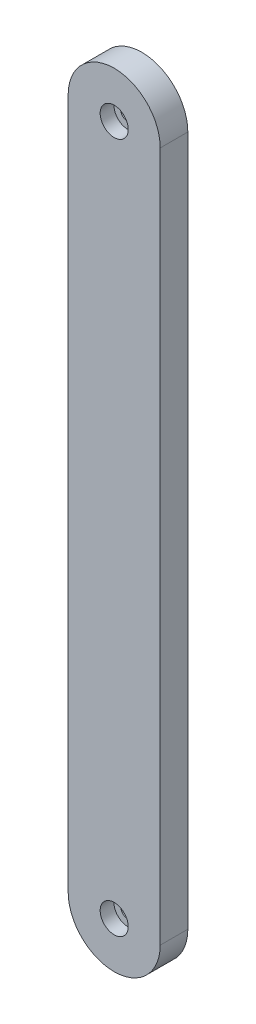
ISO-10303-21;
HEADER;
FILE_DESCRIPTION(('STEP AP214'),'2;1');
FILE_NAME('part.step','',(''),(''),'','','');
FILE_SCHEMA(('AUTOMOTIVE_DESIGN { 1 0 10303 214 1 1 1 1 }'));
ENDSEC;
DATA;
#1=APPLICATION_CONTEXT('core data for automotive mechanical design processes');
#2=APPLICATION_PROTOCOL_DEFINITION('international standard','automotive_design',2000,#1);
#3=PRODUCT_CONTEXT('',#1,'mechanical');
#4=PRODUCT('Part','Part','',(#3));
#5=PRODUCT_RELATED_PRODUCT_CATEGORY('part','',(#4));
#6=PRODUCT_DEFINITION_FORMATION('','',#4);
#7=PRODUCT_DEFINITION_CONTEXT('part definition',#1,'design');
#8=PRODUCT_DEFINITION('design','',#6,#7);
#9=PRODUCT_DEFINITION_SHAPE('','',#8);
#10=(LENGTH_UNIT() NAMED_UNIT(*) SI_UNIT(.MILLI.,.METRE.));
#11=(NAMED_UNIT(*) PLANE_ANGLE_UNIT() SI_UNIT($,.RADIAN.));
#12=(NAMED_UNIT(*) SI_UNIT($,.STERADIAN.) SOLID_ANGLE_UNIT());
#13=UNCERTAINTY_MEASURE_WITH_UNIT(LENGTH_MEASURE(1.E-05),#10,'distance_accuracy_value','');
#14=(GEOMETRIC_REPRESENTATION_CONTEXT(3) GLOBAL_UNCERTAINTY_ASSIGNED_CONTEXT((#13)) GLOBAL_UNIT_ASSIGNED_CONTEXT((#10,
#11,#12)) REPRESENTATION_CONTEXT('',''));
#15=CARTESIAN_POINT('',(0.,0.,0.));
#16=DIRECTION('',(0.,0.,1.));
#17=DIRECTION('',(1.,0.,0.));
#18=AXIS2_PLACEMENT_3D('',#15,#16,#17);
#19=CARTESIAN_POINT('',(0.,0.,6.));
#20=DIRECTION('',(0.,0.,-1.));
#21=DIRECTION('',(-1.,0.,0.));
#22=AXIS2_PLACEMENT_3D('',#19,#20,#21);
#23=CYLINDRICAL_SURFACE('',#22,1.6);
#24=CARTESIAN_POINT('',(0.,0.,0.));
#25=DIRECTION('',(0.,0.,1.));
#26=DIRECTION('',(1.,0.,0.));
#27=AXIS2_PLACEMENT_3D('',#24,#25,#26);
#28=CIRCLE('',#27,1.6);
#29=CARTESIAN_POINT('',(1.6,0.,0.));
#30=VERTEX_POINT('',#29);
#31=EDGE_CURVE('E104',#30,#30,#28,.T.);
#32=ORIENTED_EDGE('',*,*,#31,.F.);
#33=EDGE_LOOP('',(#32));
#34=FACE_BOUND('',#33,.T.);
#35=CARTESIAN_POINT('',(0.,0.,3.));
#36=DIRECTION('',(0.,0.,1.));
#37=DIRECTION('',(1.,0.,0.));
#38=AXIS2_PLACEMENT_3D('',#35,#36,#37);
#39=CIRCLE('',#38,1.6);
#40=CARTESIAN_POINT('',(1.6,0.,3.));
#41=VERTEX_POINT('',#40);
#42=EDGE_CURVE('E38',#41,#41,#39,.T.);
#43=ORIENTED_EDGE('',*,*,#42,.T.);
#44=EDGE_LOOP('',(#43));
#45=FACE_BOUND('',#44,.T.);
#46=ADVANCED_FACE('F34',(#34,#45),#23,.F.);
#47=CARTESIAN_POINT('',(0.,150.,6.));
#48=DIRECTION('',(0.,0.,-1.));
#49=DIRECTION('',(-1.,0.,0.));
#50=AXIS2_PLACEMENT_3D('',#47,#48,#49);
#51=CYLINDRICAL_SURFACE('',#50,1.6);
#52=CARTESIAN_POINT('',(0.,150.,0.));
#53=DIRECTION('',(0.,0.,1.));
#54=DIRECTION('',(1.,0.,0.));
#55=AXIS2_PLACEMENT_3D('',#52,#53,#54);
#56=CIRCLE('',#55,1.6);
#57=CARTESIAN_POINT('',(1.6,150.,0.));
#58=VERTEX_POINT('',#57);
#59=EDGE_CURVE('E111',#58,#58,#56,.T.);
#60=ORIENTED_EDGE('',*,*,#59,.F.);
#61=EDGE_LOOP('',(#60));
#62=FACE_BOUND('',#61,.T.);
#63=CARTESIAN_POINT('',(0.,150.,3.));
#64=DIRECTION('',(0.,0.,1.));
#65=DIRECTION('',(1.,0.,0.));
#66=AXIS2_PLACEMENT_3D('',#63,#64,#65);
#67=CIRCLE('',#66,1.6);
#68=CARTESIAN_POINT('',(1.6,150.,3.));
#69=VERTEX_POINT('',#68);
#70=EDGE_CURVE('E109',#69,#69,#67,.T.);
#71=ORIENTED_EDGE('',*,*,#70,.T.);
#72=EDGE_LOOP('',(#71));
#73=FACE_BOUND('',#72,.T.);
#74=ADVANCED_FACE('F136',(#62,#73),#51,.F.);
#75=CARTESIAN_POINT('',(0.,0.,6.));
#76=DIRECTION('',(0.,0.,1.));
#77=DIRECTION('',(1.,0.,0.));
#78=AXIS2_PLACEMENT_3D('',#75,#76,#77);
#79=PLANE('',#78);
#80=CARTESIAN_POINT('',(0.,0.,6.));
#81=DIRECTION('',(0.,0.,1.));
#82=DIRECTION('',(1.,0.,0.));
#83=AXIS2_PLACEMENT_3D('',#80,#81,#82);
#84=CIRCLE('',#83,3.05);
#85=CARTESIAN_POINT('',(3.05,0.,6.));
#86=VERTEX_POINT('',#85);
#87=EDGE_CURVE('E125',#86,#86,#84,.T.);
#88=ORIENTED_EDGE('',*,*,#87,.F.);
#89=EDGE_LOOP('',(#88));
#90=FACE_BOUND('',#89,.T.);
#91=CARTESIAN_POINT('',(0.,150.,6.));
#92=DIRECTION('',(0.,0.,1.));
#93=DIRECTION('',(1.,0.,0.));
#94=AXIS2_PLACEMENT_3D('',#91,#92,#93);
#95=CIRCLE('',#94,3.05);
#96=CARTESIAN_POINT('',(3.05,150.,6.));
#97=VERTEX_POINT('',#96);
#98=EDGE_CURVE('E118',#97,#97,#95,.T.);
#99=ORIENTED_EDGE('',*,*,#98,.F.);
#100=EDGE_LOOP('',(#99));
#101=FACE_BOUND('',#100,.T.);
#102=CARTESIAN_POINT('',(0.,0.,6.));
#103=DIRECTION('',(0.,0.,1.));
#104=DIRECTION('',(1.,0.,0.));
#105=AXIS2_PLACEMENT_3D('',#102,#103,#104);
#106=CIRCLE('',#105,10.);
#107=CARTESIAN_POINT('',(-10.,0.,6.));
#108=VERTEX_POINT('',#107);
#109=CARTESIAN_POINT('',(10.,0.,6.));
#110=VERTEX_POINT('',#109);
#111=EDGE_CURVE('E88',#108,#110,#106,.T.);
#112=ORIENTED_EDGE('',*,*,#111,.T.);
#113=DIRECTION('',(0.,1.,0.));
#114=VECTOR('',#113,1.);
#115=CARTESIAN_POINT('',(10.,0.,6.));
#116=LINE('',#115,#114);
#117=CARTESIAN_POINT('',(10.,150.,6.));
#118=VERTEX_POINT('',#117);
#119=EDGE_CURVE('E83',#110,#118,#116,.T.);
#120=ORIENTED_EDGE('',*,*,#119,.T.);
#121=CARTESIAN_POINT('',(0.,150.,6.));
#122=DIRECTION('',(0.,0.,1.));
#123=DIRECTION('',(1.,0.,0.));
#124=AXIS2_PLACEMENT_3D('',#121,#122,#123);
#125=CIRCLE('',#124,10.);
#126=CARTESIAN_POINT('',(-10.,150.,6.));
#127=VERTEX_POINT('',#126);
#128=EDGE_CURVE('E86',#118,#127,#125,.T.);
#129=ORIENTED_EDGE('',*,*,#128,.T.);
#130=DIRECTION('',(0.,-1.,0.));
#131=VECTOR('',#130,1.);
#132=CARTESIAN_POINT('',(-10.,0.,6.));
#133=LINE('',#132,#131);
#134=EDGE_CURVE('E53',#127,#108,#133,.T.);
#135=ORIENTED_EDGE('',*,*,#134,.T.);
#136=EDGE_LOOP('',(#112,#120,#129,#135));
#137=FACE_BOUND('',#136,.T.);
#138=ADVANCED_FACE('F84',(#90,#101,#137),#79,.T.);
#139=CARTESIAN_POINT('',(0.,0.,0.));
#140=DIRECTION('',(0.,0.,1.));
#141=DIRECTION('',(1.,0.,0.));
#142=AXIS2_PLACEMENT_3D('',#139,#140,#141);
#143=PLANE('',#142);
#144=ORIENTED_EDGE('',*,*,#31,.T.);
#145=EDGE_LOOP('',(#144));
#146=FACE_BOUND('',#145,.T.);
#147=CARTESIAN_POINT('',(0.,0.,0.));
#148=DIRECTION('',(0.,0.,1.));
#149=DIRECTION('',(1.,0.,0.));
#150=AXIS2_PLACEMENT_3D('',#147,#148,#149);
#151=CIRCLE('',#150,10.);
#152=CARTESIAN_POINT('',(-10.,0.,0.));
#153=VERTEX_POINT('',#152);
#154=CARTESIAN_POINT('',(10.,0.,0.));
#155=VERTEX_POINT('',#154);
#156=EDGE_CURVE('E101',#153,#155,#151,.T.);
#157=ORIENTED_EDGE('',*,*,#156,.F.);
#158=DIRECTION('',(0.,-1.,0.));
#159=VECTOR('',#158,1.);
#160=CARTESIAN_POINT('',(-10.,0.,0.));
#161=LINE('',#160,#159);
#162=CARTESIAN_POINT('',(-10.,150.,0.));
#163=VERTEX_POINT('',#162);
#164=EDGE_CURVE('E76',#163,#153,#161,.T.);
#165=ORIENTED_EDGE('',*,*,#164,.F.);
#166=CARTESIAN_POINT('',(0.,150.,0.));
#167=DIRECTION('',(0.,0.,1.));
#168=DIRECTION('',(1.,0.,0.));
#169=AXIS2_PLACEMENT_3D('',#166,#167,#168);
#170=CIRCLE('',#169,10.);
#171=CARTESIAN_POINT('',(10.,150.,0.));
#172=VERTEX_POINT('',#171);
#173=EDGE_CURVE('E70',#172,#163,#170,.T.);
#174=ORIENTED_EDGE('',*,*,#173,.F.);
#175=DIRECTION('',(0.,1.,0.));
#176=VECTOR('',#175,1.);
#177=CARTESIAN_POINT('',(10.,0.,0.));
#178=LINE('',#177,#176);
#179=EDGE_CURVE('E92',#155,#172,#178,.T.);
#180=ORIENTED_EDGE('',*,*,#179,.F.);
#181=EDGE_LOOP('',(#157,#165,#174,#180));
#182=FACE_BOUND('',#181,.T.);
#183=ORIENTED_EDGE('',*,*,#59,.T.);
#184=EDGE_LOOP('',(#183));
#185=FACE_BOUND('',#184,.T.);
#186=ADVANCED_FACE('F131',(#146,#182,#185),#143,.F.);
#187=CARTESIAN_POINT('',(0.,0.,6.));
#188=DIRECTION('',(0.,0.,-1.));
#189=DIRECTION('',(-1.,0.,0.));
#190=AXIS2_PLACEMENT_3D('',#187,#188,#189);
#191=CYLINDRICAL_SURFACE('',#190,10.);
#192=ORIENTED_EDGE('',*,*,#156,.T.);
#193=DIRECTION('',(0.,0.,-1.));
#194=VECTOR('',#193,1.);
#195=CARTESIAN_POINT('',(10.,0.,6.));
#196=LINE('',#195,#194);
#197=EDGE_CURVE('E11',#110,#155,#196,.T.);
#198=ORIENTED_EDGE('',*,*,#197,.F.);
#199=ORIENTED_EDGE('',*,*,#111,.F.);
#200=DIRECTION('',(0.,0.,-1.));
#201=VECTOR('',#200,1.);
#202=CARTESIAN_POINT('',(-10.,0.,6.));
#203=LINE('',#202,#201);
#204=EDGE_CURVE('E97',#108,#153,#203,.T.);
#205=ORIENTED_EDGE('',*,*,#204,.T.);
#206=EDGE_LOOP('',(#192,#198,#199,#205));
#207=FACE_BOUND('',#206,.T.);
#208=ADVANCED_FACE('F36',(#207),#191,.T.);
#209=CARTESIAN_POINT('',(10.,0.,6.));
#210=DIRECTION('',(-1.,0.,0.));
#211=DIRECTION('',(0.,0.,1.));
#212=AXIS2_PLACEMENT_3D('',#209,#210,#211);
#213=PLANE('',#212);
#214=ORIENTED_EDGE('',*,*,#179,.T.);
#215=DIRECTION('',(0.,0.,-1.));
#216=VECTOR('',#215,1.);
#217=CARTESIAN_POINT('',(10.,150.,6.));
#218=LINE('',#217,#216);
#219=EDGE_CURVE('E44',#118,#172,#218,.T.);
#220=ORIENTED_EDGE('',*,*,#219,.F.);
#221=ORIENTED_EDGE('',*,*,#119,.F.);
#222=ORIENTED_EDGE('',*,*,#197,.T.);
#223=EDGE_LOOP('',(#214,#220,#221,#222));
#224=FACE_BOUND('',#223,.T.);
#225=ADVANCED_FACE('F91',(#224),#213,.F.);
#226=CARTESIAN_POINT('',(0.,150.,6.));
#227=DIRECTION('',(0.,0.,-1.));
#228=DIRECTION('',(-1.,0.,0.));
#229=AXIS2_PLACEMENT_3D('',#226,#227,#228);
#230=CYLINDRICAL_SURFACE('',#229,10.);
#231=ORIENTED_EDGE('',*,*,#173,.T.);
#232=DIRECTION('',(0.,0.,-1.));
#233=VECTOR('',#232,1.);
#234=CARTESIAN_POINT('',(-10.,150.,6.));
#235=LINE('',#234,#233);
#236=EDGE_CURVE('E93',#127,#163,#235,.T.);
#237=ORIENTED_EDGE('',*,*,#236,.F.);
#238=ORIENTED_EDGE('',*,*,#128,.F.);
#239=ORIENTED_EDGE('',*,*,#219,.T.);
#240=EDGE_LOOP('',(#231,#237,#238,#239));
#241=FACE_BOUND('',#240,.T.);
#242=ADVANCED_FACE('F95',(#241),#230,.T.);
#243=CARTESIAN_POINT('',(-10.,0.,6.));
#244=DIRECTION('',(1.,0.,0.));
#245=DIRECTION('',(0.,0.,-1.));
#246=AXIS2_PLACEMENT_3D('',#243,#244,#245);
#247=PLANE('',#246);
#248=ORIENTED_EDGE('',*,*,#164,.T.);
#249=ORIENTED_EDGE('',*,*,#204,.F.);
#250=ORIENTED_EDGE('',*,*,#134,.F.);
#251=ORIENTED_EDGE('',*,*,#236,.T.);
#252=EDGE_LOOP('',(#248,#249,#250,#251));
#253=FACE_BOUND('',#252,.T.);
#254=ADVANCED_FACE('F158',(#253),#247,.F.);
#255=CARTESIAN_POINT('',(0.,150.,3.));
#256=DIRECTION('',(0.,0.,1.));
#257=DIRECTION('',(1.,0.,0.));
#258=AXIS2_PLACEMENT_3D('',#255,#256,#257);
#259=CYLINDRICAL_SURFACE('',#258,3.05);
#260=CARTESIAN_POINT('',(0.,150.,3.));
#261=DIRECTION('',(0.,0.,1.));
#262=DIRECTION('',(1.,0.,0.));
#263=AXIS2_PLACEMENT_3D('',#260,#261,#262);
#264=CIRCLE('',#263,3.05);
#265=CARTESIAN_POINT('',(3.05,150.,3.));
#266=VERTEX_POINT('',#265);
#267=EDGE_CURVE('E112',#266,#266,#264,.T.);
#268=ORIENTED_EDGE('',*,*,#267,.F.);
#269=EDGE_LOOP('',(#268));
#270=FACE_BOUND('',#269,.T.);
#271=ORIENTED_EDGE('',*,*,#98,.T.);
#272=EDGE_LOOP('',(#271));
#273=FACE_BOUND('',#272,.T.);
#274=ADVANCED_FACE('F155',(#270,#273),#259,.F.);
#275=CARTESIAN_POINT('',(0.,150.,3.));
#276=DIRECTION('',(0.,0.,1.));
#277=DIRECTION('',(1.,0.,0.));
#278=AXIS2_PLACEMENT_3D('',#275,#276,#277);
#279=PLANE('',#278);
#280=ORIENTED_EDGE('',*,*,#70,.F.);
#281=EDGE_LOOP('',(#280));
#282=FACE_BOUND('',#281,.T.);
#283=ORIENTED_EDGE('',*,*,#267,.T.);
#284=EDGE_LOOP('',(#283));
#285=FACE_BOUND('',#284,.T.);
#286=ADVANCED_FACE('F157',(#282,#285),#279,.T.);
#287=CARTESIAN_POINT('',(0.,0.,3.));
#288=DIRECTION('',(0.,0.,1.));
#289=DIRECTION('',(1.,0.,0.));
#290=AXIS2_PLACEMENT_3D('',#287,#288,#289);
#291=CYLINDRICAL_SURFACE('',#290,3.05);
#292=CARTESIAN_POINT('',(0.,0.,3.));
#293=DIRECTION('',(0.,0.,1.));
#294=DIRECTION('',(1.,0.,0.));
#295=AXIS2_PLACEMENT_3D('',#292,#293,#294);
#296=CIRCLE('',#295,3.05);
#297=CARTESIAN_POINT('',(3.05,0.,3.));
#298=VERTEX_POINT('',#297);
#299=EDGE_CURVE('E141',#298,#298,#296,.T.);
#300=ORIENTED_EDGE('',*,*,#299,.F.);
#301=EDGE_LOOP('',(#300));
#302=FACE_BOUND('',#301,.T.);
#303=ORIENTED_EDGE('',*,*,#87,.T.);
#304=EDGE_LOOP('',(#303));
#305=FACE_BOUND('',#304,.T.);
#306=ADVANCED_FACE('F148',(#302,#305),#291,.F.);
#307=CARTESIAN_POINT('',(0.,0.,3.));
#308=DIRECTION('',(0.,0.,1.));
#309=DIRECTION('',(1.,0.,0.));
#310=AXIS2_PLACEMENT_3D('',#307,#308,#309);
#311=PLANE('',#310);
#312=ORIENTED_EDGE('',*,*,#42,.F.);
#313=EDGE_LOOP('',(#312));
#314=FACE_BOUND('',#313,.T.);
#315=ORIENTED_EDGE('',*,*,#299,.T.);
#316=EDGE_LOOP('',(#315));
#317=FACE_BOUND('',#316,.T.);
#318=ADVANCED_FACE('F245',(#314,#317),#311,.T.);
#319=CLOSED_SHELL('',(#46,#74,#138,#186,#208,#225,#242,#254,#274,#286,#306,#318));
#320=MANIFOLD_SOLID_BREP('B2',#319);
#321=ADVANCED_BREP_SHAPE_REPRESENTATION('',(#18,#320),#14);
#322=SHAPE_DEFINITION_REPRESENTATION(#9,#321);
ENDSEC;
END-ISO-10303-21;
